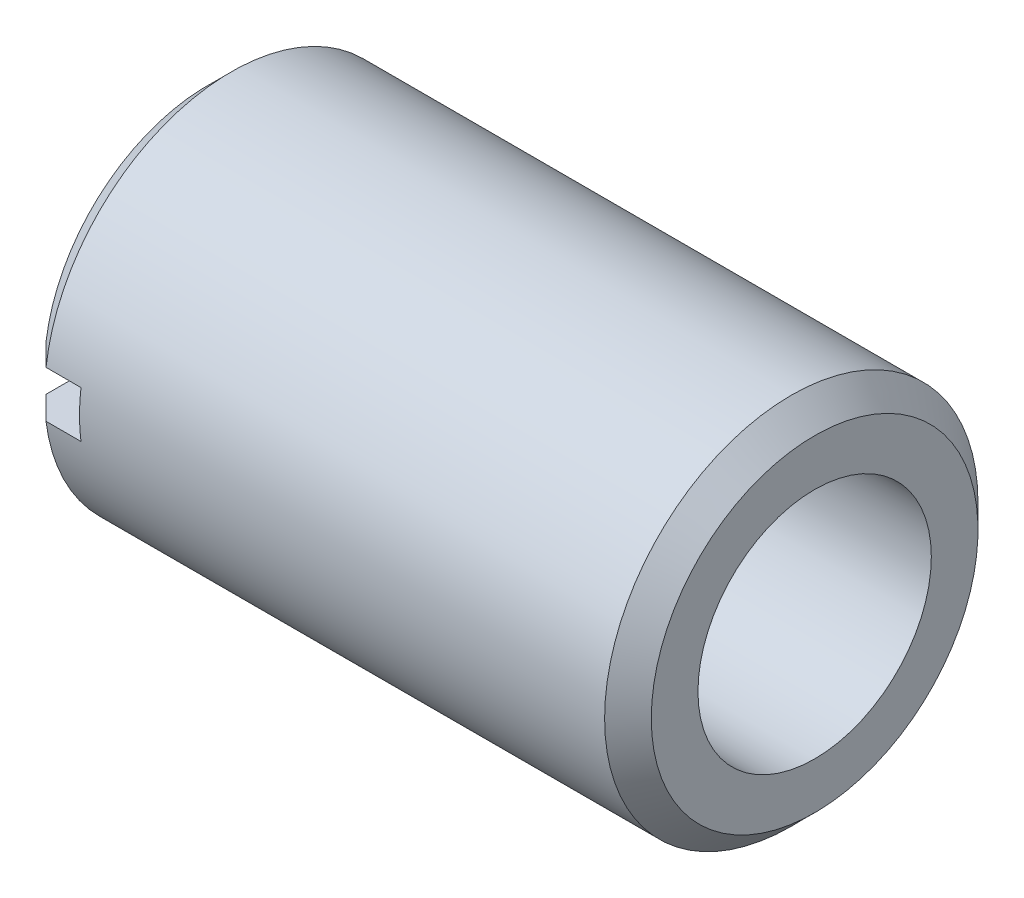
ISO-10303-21;
HEADER;
FILE_DESCRIPTION(('STEP AP214'),'2;1');
FILE_NAME('part.step','',(''),(''),'','','');
FILE_SCHEMA(('AUTOMOTIVE_DESIGN { 1 0 10303 214 1 1 1 1 }'));
ENDSEC;
DATA;
#1=APPLICATION_CONTEXT('core data for automotive mechanical design processes');
#2=APPLICATION_PROTOCOL_DEFINITION('international standard','automotive_design',2000,#1);
#3=PRODUCT_CONTEXT('',#1,'mechanical');
#4=PRODUCT('Part','Part','',(#3));
#5=PRODUCT_RELATED_PRODUCT_CATEGORY('part','',(#4));
#6=PRODUCT_DEFINITION_FORMATION('','',#4);
#7=PRODUCT_DEFINITION_CONTEXT('part definition',#1,'design');
#8=PRODUCT_DEFINITION('design','',#6,#7);
#9=PRODUCT_DEFINITION_SHAPE('','',#8);
#10=(LENGTH_UNIT() NAMED_UNIT(*) SI_UNIT(.MILLI.,.METRE.));
#11=(NAMED_UNIT(*) PLANE_ANGLE_UNIT() SI_UNIT($,.RADIAN.));
#12=(NAMED_UNIT(*) SI_UNIT($,.STERADIAN.) SOLID_ANGLE_UNIT());
#13=UNCERTAINTY_MEASURE_WITH_UNIT(LENGTH_MEASURE(1.E-05),#10,'distance_accuracy_value','');
#14=(GEOMETRIC_REPRESENTATION_CONTEXT(3) GLOBAL_UNCERTAINTY_ASSIGNED_CONTEXT((#13)) GLOBAL_UNIT_ASSIGNED_CONTEXT((#10,
#11,#12)) REPRESENTATION_CONTEXT('',''));
#15=CARTESIAN_POINT('',(0.,0.,0.));
#16=DIRECTION('',(0.,0.,1.));
#17=DIRECTION('',(1.,0.,0.));
#18=AXIS2_PLACEMENT_3D('',#15,#16,#17);
#19=CARTESIAN_POINT('',(0.,0.,0.));
#20=DIRECTION('',(1.,0.,0.));
#21=DIRECTION('',(0.,0.,-1.));
#22=AXIS2_PLACEMENT_3D('',#19,#20,#21);
#23=PLANE('',#22);
#24=DIRECTION('',(0.,0.,-1.));
#25=VECTOR('',#24,1.);
#26=CARTESIAN_POINT('',(0.,1.,-10.2825126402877));
#27=LINE('',#26,#25);
#28=CARTESIAN_POINT('',(0.,1.,6.92820323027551));
#29=VERTEX_POINT('',#28);
#30=CARTESIAN_POINT('',(0.,1.,-6.92820323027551));
#31=VERTEX_POINT('',#30);
#32=EDGE_CURVE('E107',#29,#31,#27,.T.);
#33=ORIENTED_EDGE('',*,*,#32,.F.);
#34=CARTESIAN_POINT('',(0.,0.,0.));
#35=DIRECTION('',(1.,0.,0.));
#36=DIRECTION('',(0.,0.,-1.));
#37=AXIS2_PLACEMENT_3D('',#34,#35,#36);
#38=CIRCLE('',#37,7.);
#39=EDGE_CURVE('E165',#29,#31,#38,.F.);
#40=ORIENTED_EDGE('',*,*,#39,.T.);
#41=EDGE_LOOP('',(#33,#40));
#42=FACE_BOUND('',#41,.T.);
#43=ADVANCED_FACE('F24',(#42),#23,.F.);
#44=DIRECTION('',(0.,0.,1.));
#45=VECTOR('',#44,1.);
#46=CARTESIAN_POINT('',(0.,-1.,-10.2825126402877));
#47=LINE('',#46,#45);
#48=CARTESIAN_POINT('',(0.,-1.,-6.92820323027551));
#49=VERTEX_POINT('',#48);
#50=CARTESIAN_POINT('',(0.,-1.,6.92820323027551));
#51=VERTEX_POINT('',#50);
#52=EDGE_CURVE('E166',#49,#51,#47,.T.);
#53=ORIENTED_EDGE('',*,*,#52,.F.);
#54=CARTESIAN_POINT('',(0.,0.,0.));
#55=DIRECTION('',(1.,0.,0.));
#56=DIRECTION('',(0.,0.,-1.));
#57=AXIS2_PLACEMENT_3D('',#54,#55,#56);
#58=CIRCLE('',#57,7.);
#59=EDGE_CURVE('E86',#49,#51,#58,.F.);
#60=ORIENTED_EDGE('',*,*,#59,.T.);
#61=EDGE_LOOP('',(#53,#60));
#62=FACE_BOUND('',#61,.T.);
#63=ADVANCED_FACE('F26',(#62),#23,.F.);
#64=CARTESIAN_POINT('',(0.,0.,0.));
#65=DIRECTION('',(-1.,0.,0.));
#66=DIRECTION('',(0.,0.,1.));
#67=AXIS2_PLACEMENT_3D('',#64,#65,#66);
#68=CYLINDRICAL_SURFACE('',#67,8.);
#69=CARTESIAN_POINT('',(25.,0.,0.));
#70=DIRECTION('',(-1.,0.,0.));
#71=DIRECTION('',(0.,0.,1.));
#72=AXIS2_PLACEMENT_3D('',#69,#70,#71);
#73=CIRCLE('',#72,8.);
#74=CARTESIAN_POINT('',(25.,0.,8.));
#75=VERTEX_POINT('',#74);
#76=EDGE_CURVE('E191',#75,#75,#73,.T.);
#77=ORIENTED_EDGE('',*,*,#76,.T.);
#78=EDGE_LOOP('',(#77));
#79=FACE_BOUND('',#78,.T.);
#80=DIRECTION('',(-1.,0.,0.));
#81=VECTOR('',#80,1.);
#82=CARTESIAN_POINT('',(0.,-1.,7.93725393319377));
#83=LINE('',#82,#81);
#84=CARTESIAN_POINT('',(2.5,-1.,7.93725393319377));
#85=VERTEX_POINT('',#84);
#86=CARTESIAN_POINT('',(1.,-1.,7.93725393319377));
#87=VERTEX_POINT('',#86);
#88=EDGE_CURVE('E87',#85,#87,#83,.T.);
#89=ORIENTED_EDGE('',*,*,#88,.T.);
#90=CARTESIAN_POINT('',(1.,0.,0.));
#91=DIRECTION('',(1.,0.,0.));
#92=DIRECTION('',(0.,0.,-1.));
#93=AXIS2_PLACEMENT_3D('',#90,#91,#92);
#94=CIRCLE('',#93,8.);
#95=CARTESIAN_POINT('',(1.,-1.,-7.93725393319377));
#96=VERTEX_POINT('',#95);
#97=EDGE_CURVE('E168',#87,#96,#94,.T.);
#98=ORIENTED_EDGE('',*,*,#97,.T.);
#99=DIRECTION('',(-1.,0.,0.));
#100=VECTOR('',#99,1.);
#101=CARTESIAN_POINT('',(0.,-1.,-7.93725393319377));
#102=LINE('',#101,#100);
#103=CARTESIAN_POINT('',(2.5,-1.,-7.93725393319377));
#104=VERTEX_POINT('',#103);
#105=EDGE_CURVE('E113',#96,#104,#102,.F.);
#106=ORIENTED_EDGE('',*,*,#105,.T.);
#107=CARTESIAN_POINT('',(2.5,0.,0.));
#108=DIRECTION('',(1.,0.,0.));
#109=DIRECTION('',(0.,0.,-1.));
#110=AXIS2_PLACEMENT_3D('',#107,#108,#109);
#111=CIRCLE('',#110,8.);
#112=CARTESIAN_POINT('',(2.5,1.,-7.93725393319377));
#113=VERTEX_POINT('',#112);
#114=EDGE_CURVE('E99',#104,#113,#111,.T.);
#115=ORIENTED_EDGE('',*,*,#114,.T.);
#116=DIRECTION('',(-1.,0.,0.));
#117=VECTOR('',#116,1.);
#118=CARTESIAN_POINT('',(0.,1.,-7.93725393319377));
#119=LINE('',#118,#117);
#120=CARTESIAN_POINT('',(1.,1.,-7.93725393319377));
#121=VERTEX_POINT('',#120);
#122=EDGE_CURVE('E97',#113,#121,#119,.T.);
#123=ORIENTED_EDGE('',*,*,#122,.T.);
#124=CARTESIAN_POINT('',(1.,0.,0.));
#125=DIRECTION('',(1.,0.,0.));
#126=DIRECTION('',(0.,0.,-1.));
#127=AXIS2_PLACEMENT_3D('',#124,#125,#126);
#128=CIRCLE('',#127,8.);
#129=CARTESIAN_POINT('',(1.,1.,7.93725393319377));
#130=VERTEX_POINT('',#129);
#131=EDGE_CURVE('E84',#121,#130,#128,.T.);
#132=ORIENTED_EDGE('',*,*,#131,.T.);
#133=DIRECTION('',(-1.,0.,0.));
#134=VECTOR('',#133,1.);
#135=CARTESIAN_POINT('',(0.,1.,7.93725393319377));
#136=LINE('',#135,#134);
#137=CARTESIAN_POINT('',(2.5,1.,7.93725393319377));
#138=VERTEX_POINT('',#137);
#139=EDGE_CURVE('E78',#130,#138,#136,.F.);
#140=ORIENTED_EDGE('',*,*,#139,.T.);
#141=EDGE_CURVE('E82',#138,#85,#111,.T.);
#142=ORIENTED_EDGE('',*,*,#141,.T.);
#143=EDGE_LOOP('',(#89,#98,#106,#115,#123,#132,#140,#142));
#144=FACE_BOUND('',#143,.T.);
#145=ADVANCED_FACE('F81',(#79,#144),#68,.T.);
#146=CARTESIAN_POINT('',(26.,8.,0.));
#147=DIRECTION('',(-1.,0.,0.));
#148=DIRECTION('',(0.,0.,1.));
#149=AXIS2_PLACEMENT_3D('',#146,#147,#148);
#150=PLANE('',#149);
#151=CARTESIAN_POINT('',(26.,0.,0.));
#152=DIRECTION('',(-1.,0.,0.));
#153=DIRECTION('',(0.,0.,1.));
#154=AXIS2_PLACEMENT_3D('',#151,#152,#153);
#155=CIRCLE('',#154,7.);
#156=CARTESIAN_POINT('',(26.,0.,7.));
#157=VERTEX_POINT('',#156);
#158=EDGE_CURVE('E11',#157,#157,#155,.F.);
#159=ORIENTED_EDGE('',*,*,#158,.T.);
#160=EDGE_LOOP('',(#159));
#161=FACE_BOUND('',#160,.T.);
#162=CARTESIAN_POINT('',(26.,0.,0.));
#163=DIRECTION('',(-1.,0.,0.));
#164=DIRECTION('',(0.,0.,1.));
#165=AXIS2_PLACEMENT_3D('',#162,#163,#164);
#166=CIRCLE('',#165,5.);
#167=CARTESIAN_POINT('',(26.,0.,5.));
#168=VERTEX_POINT('',#167);
#169=EDGE_CURVE('E105',#168,#168,#166,.T.);
#170=ORIENTED_EDGE('',*,*,#169,.T.);
#171=EDGE_LOOP('',(#170));
#172=FACE_BOUND('',#171,.T.);
#173=ADVANCED_FACE('F150',(#161,#172),#150,.F.);
#174=CARTESIAN_POINT('',(0.,0.,0.));
#175=DIRECTION('',(-1.,0.,0.));
#176=DIRECTION('',(0.,0.,1.));
#177=AXIS2_PLACEMENT_3D('',#174,#175,#176);
#178=CYLINDRICAL_SURFACE('',#177,5.);
#179=ORIENTED_EDGE('',*,*,#169,.F.);
#180=EDGE_LOOP('',(#179));
#181=FACE_BOUND('',#180,.T.);
#182=CARTESIAN_POINT('',(4.,0.,0.));
#183=DIRECTION('',(-1.,0.,0.));
#184=DIRECTION('',(0.,0.,1.));
#185=AXIS2_PLACEMENT_3D('',#182,#183,#184);
#186=CIRCLE('',#185,5.);
#187=CARTESIAN_POINT('',(4.,0.,5.));
#188=VERTEX_POINT('',#187);
#189=EDGE_CURVE('E102',#188,#188,#186,.T.);
#190=ORIENTED_EDGE('',*,*,#189,.T.);
#191=EDGE_LOOP('',(#190));
#192=FACE_BOUND('',#191,.T.);
#193=ADVANCED_FACE('F146',(#181,#192),#178,.F.);
#194=CARTESIAN_POINT('',(4.,5.,0.));
#195=DIRECTION('',(-1.,0.,0.));
#196=DIRECTION('',(0.,0.,1.));
#197=AXIS2_PLACEMENT_3D('',#194,#195,#196);
#198=PLANE('',#197);
#199=ORIENTED_EDGE('',*,*,#189,.F.);
#200=EDGE_LOOP('',(#199));
#201=FACE_BOUND('',#200,.T.);
#202=ADVANCED_FACE('F142',(#201),#198,.F.);
#203=CARTESIAN_POINT('',(2.5,1.,-10.2825126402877));
#204=DIRECTION('',(0.,1.,0.));
#205=DIRECTION('',(0.,0.,1.));
#206=AXIS2_PLACEMENT_3D('',#203,#204,#205);
#207=PLANE('',#206);
#208=ORIENTED_EDGE('',*,*,#32,.T.);
#209=CARTESIAN_POINT('',(0.,1.,-6.92820323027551));
#210=CARTESIAN_POINT('',(0.166564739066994,1.,-7.09647936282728));
#211=CARTESIAN_POINT('',(0.333180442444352,1.,-7.26470498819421));
#212=CARTESIAN_POINT('',(0.666513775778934,1.,-7.60105522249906));
#213=CARTESIAN_POINT('',(0.83323140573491,1.,-7.76917983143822));
#214=CARTESIAN_POINT('',(1.,1.,-7.93725393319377));
#215=B_SPLINE_CURVE_WITH_KNOTS('',3,(#209,#210,#211,#212,#213,#214),.UNSPECIFIED.,.F.,.F.,(4,2,
4),(0.,0.710313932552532,1.42062785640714),.UNSPECIFIED.);
#216=EDGE_CURVE('E32',#31,#121,#215,.T.);
#217=ORIENTED_EDGE('',*,*,#216,.T.);
#218=ORIENTED_EDGE('',*,*,#122,.F.);
#219=DIRECTION('',(0.,0.,-1.));
#220=VECTOR('',#219,1.);
#221=CARTESIAN_POINT('',(2.5,1.,-10.2825126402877));
#222=LINE('',#221,#220);
#223=EDGE_CURVE('E93',#138,#113,#222,.T.);
#224=ORIENTED_EDGE('',*,*,#223,.F.);
#225=ORIENTED_EDGE('',*,*,#139,.F.);
#226=CARTESIAN_POINT('',(1.,1.,7.93725393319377));
#227=CARTESIAN_POINT('',(0.83323140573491,1.,7.76917983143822));
#228=CARTESIAN_POINT('',(0.666513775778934,1.,7.60105522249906));
#229=CARTESIAN_POINT('',(0.333180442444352,1.,7.26470498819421));
#230=CARTESIAN_POINT('',(0.166564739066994,1.,7.09647936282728));
#231=CARTESIAN_POINT('',(0.,1.,6.92820323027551));
#232=B_SPLINE_CURVE_WITH_KNOTS('',3,(#226,#227,#228,#229,#230,#231),.UNSPECIFIED.,.F.,.F.,(4,2,
4),(0.,0.710313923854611,1.42062785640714),.UNSPECIFIED.);
#233=EDGE_CURVE('E46',#130,#29,#232,.T.);
#234=ORIENTED_EDGE('',*,*,#233,.T.);
#235=EDGE_LOOP('',(#208,#217,#218,#224,#225,#234));
#236=FACE_BOUND('',#235,.T.);
#237=ADVANCED_FACE('F100',(#236),#207,.F.);
#238=CARTESIAN_POINT('',(2.5,-1.,-10.2825126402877));
#239=DIRECTION('',(0.,-1.,0.));
#240=DIRECTION('',(0.,0.,-1.));
#241=AXIS2_PLACEMENT_3D('',#238,#239,#240);
#242=PLANE('',#241);
#243=ORIENTED_EDGE('',*,*,#52,.T.);
#244=CARTESIAN_POINT('',(0.,-1.,6.92820323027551));
#245=CARTESIAN_POINT('',(0.166564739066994,-1.,7.09647936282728));
#246=CARTESIAN_POINT('',(0.333180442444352,-1.,7.26470498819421));
#247=CARTESIAN_POINT('',(0.666513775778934,-1.,7.60105522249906));
#248=CARTESIAN_POINT('',(0.83323140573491,-1.,7.76917983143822));
#249=CARTESIAN_POINT('',(1.,-1.,7.93725393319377));
#250=B_SPLINE_CURVE_WITH_KNOTS('',3,(#244,#245,#246,#247,#248,#249),.UNSPECIFIED.,.F.,.F.,(4,2,
4),(0.,0.710313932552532,1.42062785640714),.UNSPECIFIED.);
#251=EDGE_CURVE('E126',#51,#87,#250,.T.);
#252=ORIENTED_EDGE('',*,*,#251,.T.);
#253=ORIENTED_EDGE('',*,*,#88,.F.);
#254=DIRECTION('',(0.,0.,1.));
#255=VECTOR('',#254,1.);
#256=CARTESIAN_POINT('',(2.5,-1.,-10.2825126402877));
#257=LINE('',#256,#255);
#258=EDGE_CURVE('E96',#104,#85,#257,.T.);
#259=ORIENTED_EDGE('',*,*,#258,.F.);
#260=ORIENTED_EDGE('',*,*,#105,.F.);
#261=CARTESIAN_POINT('',(1.,-1.,-7.93725393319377));
#262=CARTESIAN_POINT('',(0.83323140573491,-1.,-7.76917983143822));
#263=CARTESIAN_POINT('',(0.666513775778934,-1.,-7.60105522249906));
#264=CARTESIAN_POINT('',(0.333180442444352,-1.,-7.26470498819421));
#265=CARTESIAN_POINT('',(0.166564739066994,-1.,-7.09647936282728));
#266=CARTESIAN_POINT('',(0.,-1.,-6.92820323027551));
#267=B_SPLINE_CURVE_WITH_KNOTS('',3,(#261,#262,#263,#264,#265,#266),.UNSPECIFIED.,.F.,.F.,(4,2,
4),(0.,0.710313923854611,1.42062785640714),.UNSPECIFIED.);
#268=EDGE_CURVE('E119',#96,#49,#267,.T.);
#269=ORIENTED_EDGE('',*,*,#268,.T.);
#270=EDGE_LOOP('',(#243,#252,#253,#259,#260,#269));
#271=FACE_BOUND('',#270,.T.);
#272=ADVANCED_FACE('F135',(#271),#242,.F.);
#273=CARTESIAN_POINT('',(2.5,1.,-10.2825126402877));
#274=DIRECTION('',(1.,0.,0.));
#275=DIRECTION('',(0.,0.,-1.));
#276=AXIS2_PLACEMENT_3D('',#273,#274,#275);
#277=PLANE('',#276);
#278=ORIENTED_EDGE('',*,*,#223,.T.);
#279=ORIENTED_EDGE('',*,*,#114,.F.);
#280=ORIENTED_EDGE('',*,*,#258,.T.);
#281=ORIENTED_EDGE('',*,*,#141,.F.);
#282=EDGE_LOOP('',(#278,#279,#280,#281));
#283=FACE_BOUND('',#282,.T.);
#284=ADVANCED_FACE('F91',(#283),#277,.F.);
#285=CARTESIAN_POINT('',(0.,0.,0.));
#286=DIRECTION('',(1.,0.,0.));
#287=DIRECTION('',(0.,0.,-1.));
#288=AXIS2_PLACEMENT_3D('',#285,#286,#287);
#289=CONICAL_SURFACE('',#288,7.,0.785398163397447);
#290=ORIENTED_EDGE('',*,*,#268,.F.);
#291=ORIENTED_EDGE('',*,*,#97,.F.);
#292=ORIENTED_EDGE('',*,*,#251,.F.);
#293=ORIENTED_EDGE('',*,*,#59,.F.);
#294=EDGE_LOOP('',(#290,#291,#292,#293));
#295=FACE_BOUND('',#294,.T.);
#296=ADVANCED_FACE('F131',(#295),#289,.T.);
#297=CARTESIAN_POINT('',(0.,0.,0.));
#298=DIRECTION('',(1.,0.,0.));
#299=DIRECTION('',(0.,0.,-1.));
#300=AXIS2_PLACEMENT_3D('',#297,#298,#299);
#301=CONICAL_SURFACE('',#300,7.,0.785398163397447);
#302=ORIENTED_EDGE('',*,*,#233,.F.);
#303=ORIENTED_EDGE('',*,*,#131,.F.);
#304=ORIENTED_EDGE('',*,*,#216,.F.);
#305=ORIENTED_EDGE('',*,*,#39,.F.);
#306=EDGE_LOOP('',(#302,#303,#304,#305));
#307=FACE_BOUND('',#306,.T.);
#308=ADVANCED_FACE('F167',(#307),#301,.T.);
#309=CARTESIAN_POINT('',(25.,0.,0.));
#310=DIRECTION('',(-1.,0.,0.));
#311=DIRECTION('',(0.,0.,1.));
#312=AXIS2_PLACEMENT_3D('',#309,#310,#311);
#313=CONICAL_SURFACE('',#312,8.,0.785398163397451);
#314=ORIENTED_EDGE('',*,*,#158,.F.);
#315=EDGE_LOOP('',(#314));
#316=FACE_BOUND('',#315,.T.);
#317=ORIENTED_EDGE('',*,*,#76,.F.);
#318=EDGE_LOOP('',(#317));
#319=FACE_BOUND('',#318,.T.);
#320=ADVANCED_FACE('F182',(#316,#319),#313,.T.);
#321=CLOSED_SHELL('',(#43,#63,#145,#173,#193,#202,#237,#272,#284,#296,#308,#320));
#322=MANIFOLD_SOLID_BREP('B2',#321);
#323=ADVANCED_BREP_SHAPE_REPRESENTATION('',(#18,#322),#14);
#324=SHAPE_DEFINITION_REPRESENTATION(#9,#323);
ENDSEC;
END-ISO-10303-21;
